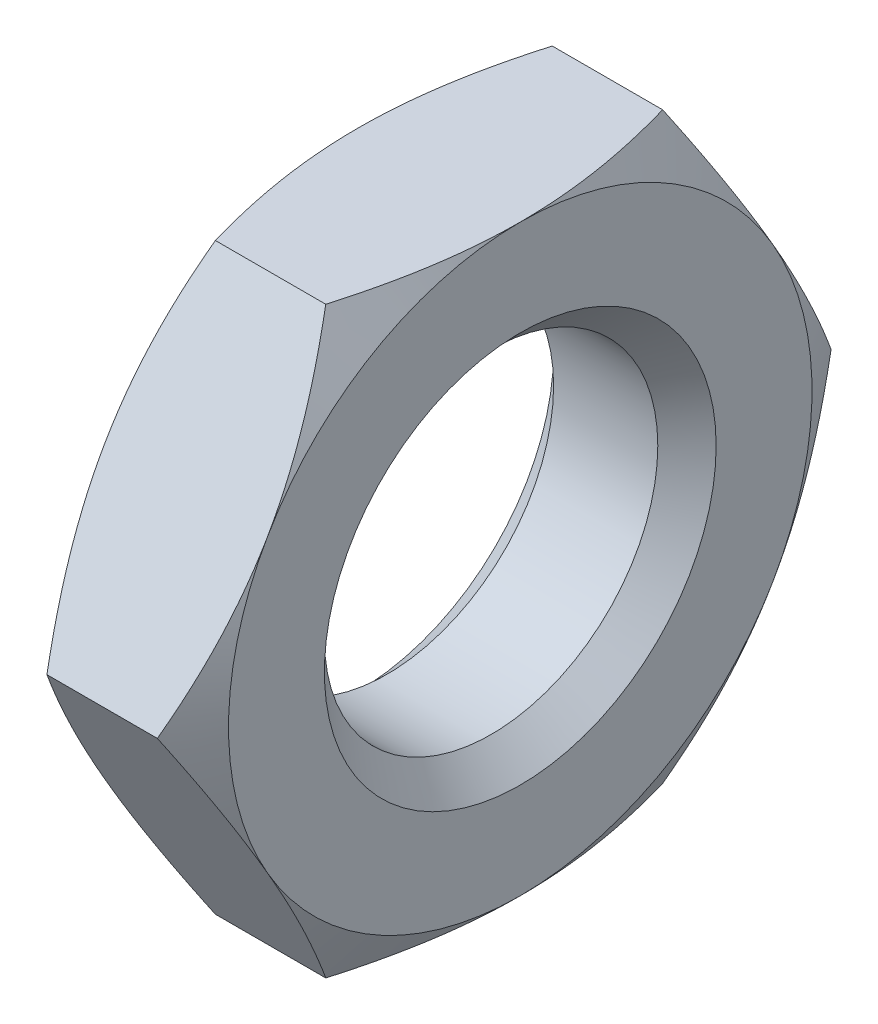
ISO-10303-21;
HEADER;
FILE_DESCRIPTION(('STEP AP214'),'2;1');
FILE_NAME('part.step','',(''),(''),'','','');
FILE_SCHEMA(('AUTOMOTIVE_DESIGN { 1 0 10303 214 1 1 1 1 }'));
ENDSEC;
DATA;
#1=APPLICATION_CONTEXT('core data for automotive mechanical design processes');
#2=APPLICATION_PROTOCOL_DEFINITION('international standard','automotive_design',2000,#1);
#3=PRODUCT_CONTEXT('',#1,'mechanical');
#4=PRODUCT('Part','Part','',(#3));
#5=PRODUCT_RELATED_PRODUCT_CATEGORY('part','',(#4));
#6=PRODUCT_DEFINITION_FORMATION('','',#4);
#7=PRODUCT_DEFINITION_CONTEXT('part definition',#1,'design');
#8=PRODUCT_DEFINITION('design','',#6,#7);
#9=PRODUCT_DEFINITION_SHAPE('','',#8);
#10=(LENGTH_UNIT() NAMED_UNIT(*) SI_UNIT(.MILLI.,.METRE.));
#11=(NAMED_UNIT(*) PLANE_ANGLE_UNIT() SI_UNIT($,.RADIAN.));
#12=(NAMED_UNIT(*) SI_UNIT($,.STERADIAN.) SOLID_ANGLE_UNIT());
#13=UNCERTAINTY_MEASURE_WITH_UNIT(LENGTH_MEASURE(1.E-05),#10,'distance_accuracy_value','');
#14=(GEOMETRIC_REPRESENTATION_CONTEXT(3) GLOBAL_UNCERTAINTY_ASSIGNED_CONTEXT((#13)) GLOBAL_UNIT_ASSIGNED_CONTEXT((#10,
#11,#12)) REPRESENTATION_CONTEXT('',''));
#15=CARTESIAN_POINT('',(0.,0.,0.));
#16=DIRECTION('',(0.,0.,1.));
#17=DIRECTION('',(1.,0.,0.));
#18=AXIS2_PLACEMENT_3D('',#15,#16,#17);
#19=CARTESIAN_POINT('',(1.95,3.5,-2.02072594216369));
#20=DIRECTION('',(1.,0.,0.));
#21=DIRECTION('',(0.,0.,-1.));
#22=AXIS2_PLACEMENT_3D('',#19,#20,#21);
#23=PLANE('',#22);
#24=CARTESIAN_POINT('',(1.95,0.,0.));
#25=DIRECTION('',(1.,0.,0.));
#26=DIRECTION('',(0.,0.,-1.));
#27=AXIS2_PLACEMENT_3D('',#24,#25,#26);
#28=CIRCLE('',#27,2.35);
#29=CARTESIAN_POINT('',(1.95,0.,-2.35));
#30=VERTEX_POINT('',#29);
#31=EDGE_CURVE('E11',#30,#30,#28,.F.);
#32=ORIENTED_EDGE('',*,*,#31,.T.);
#33=EDGE_LOOP('',(#32));
#34=FACE_BOUND('',#33,.T.);
#35=CARTESIAN_POINT('',(1.95,0.,0.));
#36=DIRECTION('',(1.,0.,0.));
#37=DIRECTION('',(0.,0.,-1.));
#38=AXIS2_PLACEMENT_3D('',#35,#36,#37);
#39=CIRCLE('',#38,3.5);
#40=CARTESIAN_POINT('',(1.95,-3.5,0.));
#41=VERTEX_POINT('',#40);
#42=CARTESIAN_POINT('',(1.95,-1.75,-3.03108891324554));
#43=VERTEX_POINT('',#42);
#44=EDGE_CURVE('E142',#41,#43,#39,.T.);
#45=ORIENTED_EDGE('',*,*,#44,.T.);
#46=CARTESIAN_POINT('',(1.95,1.75,-3.03108891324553));
#47=VERTEX_POINT('',#46);
#48=EDGE_CURVE('E130',#43,#47,#39,.T.);
#49=ORIENTED_EDGE('',*,*,#48,.T.);
#50=CARTESIAN_POINT('',(1.95,3.5,0.));
#51=VERTEX_POINT('',#50);
#52=EDGE_CURVE('E144',#47,#51,#39,.T.);
#53=ORIENTED_EDGE('',*,*,#52,.T.);
#54=CARTESIAN_POINT('',(1.95,1.75,3.03108891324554));
#55=VERTEX_POINT('',#54);
#56=EDGE_CURVE('E55',#51,#55,#39,.T.);
#57=ORIENTED_EDGE('',*,*,#56,.T.);
#58=CARTESIAN_POINT('',(1.95,-1.75,3.03108891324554));
#59=VERTEX_POINT('',#58);
#60=EDGE_CURVE('E63',#55,#59,#39,.T.);
#61=ORIENTED_EDGE('',*,*,#60,.T.);
#62=EDGE_CURVE('E166',#59,#41,#39,.T.);
#63=ORIENTED_EDGE('',*,*,#62,.T.);
#64=EDGE_LOOP('',(#45,#49,#53,#57,#61,#63));
#65=FACE_BOUND('',#64,.T.);
#66=ADVANCED_FACE('F39',(#34,#65),#23,.T.);
#67=CARTESIAN_POINT('',(0.,3.5,-2.02072594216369));
#68=DIRECTION('',(1.,0.,0.));
#69=DIRECTION('',(0.,0.,-1.));
#70=AXIS2_PLACEMENT_3D('',#67,#68,#69);
#71=PLANE('',#70);
#72=CARTESIAN_POINT('',(0.,0.,0.));
#73=DIRECTION('',(1.,0.,0.));
#74=DIRECTION('',(0.,0.,-1.));
#75=AXIS2_PLACEMENT_3D('',#72,#73,#74);
#76=CIRCLE('',#75,2.35);
#77=CARTESIAN_POINT('',(0.,0.,-2.35));
#78=VERTEX_POINT('',#77);
#79=EDGE_CURVE('E164',#78,#78,#76,.T.);
#80=ORIENTED_EDGE('',*,*,#79,.T.);
#81=EDGE_LOOP('',(#80));
#82=FACE_BOUND('',#81,.T.);
#83=CARTESIAN_POINT('',(0.,0.,0.));
#84=DIRECTION('',(1.,0.,0.));
#85=DIRECTION('',(0.,0.,-1.));
#86=AXIS2_PLACEMENT_3D('',#83,#84,#85);
#87=CIRCLE('',#86,3.5);
#88=CARTESIAN_POINT('',(0.,-1.75,-3.03108891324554));
#89=VERTEX_POINT('',#88);
#90=CARTESIAN_POINT('',(0.,1.75,-3.03108891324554));
#91=VERTEX_POINT('',#90);
#92=EDGE_CURVE('E173',#89,#91,#87,.T.);
#93=ORIENTED_EDGE('',*,*,#92,.F.);
#94=CARTESIAN_POINT('',(0.,-3.5,0.));
#95=VERTEX_POINT('',#94);
#96=EDGE_CURVE('E320',#95,#89,#87,.T.);
#97=ORIENTED_EDGE('',*,*,#96,.F.);
#98=CARTESIAN_POINT('',(0.,-1.75,3.03108891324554));
#99=VERTEX_POINT('',#98);
#100=EDGE_CURVE('E323',#99,#95,#87,.T.);
#101=ORIENTED_EDGE('',*,*,#100,.F.);
#102=CARTESIAN_POINT('',(0.,1.75,3.03108891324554));
#103=VERTEX_POINT('',#102);
#104=EDGE_CURVE('E328',#103,#99,#87,.T.);
#105=ORIENTED_EDGE('',*,*,#104,.F.);
#106=CARTESIAN_POINT('',(0.,3.5,0.));
#107=VERTEX_POINT('',#106);
#108=EDGE_CURVE('E178',#107,#103,#87,.T.);
#109=ORIENTED_EDGE('',*,*,#108,.F.);
#110=EDGE_CURVE('E174',#91,#107,#87,.T.);
#111=ORIENTED_EDGE('',*,*,#110,.F.);
#112=EDGE_LOOP('',(#93,#97,#101,#105,#109,#111));
#113=FACE_BOUND('',#112,.T.);
#114=ADVANCED_FACE('F321',(#82,#113),#71,.F.);
#115=CARTESIAN_POINT('',(1.95,0.,0.));
#116=DIRECTION('',(-1.,0.,0.));
#117=DIRECTION('',(0.,0.,1.));
#118=AXIS2_PLACEMENT_3D('',#115,#116,#117);
#119=CYLINDRICAL_SURFACE('',#118,2.);
#120=CARTESIAN_POINT('',(0.349999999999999,0.,0.));
#121=DIRECTION('',(1.,0.,0.));
#122=DIRECTION('',(0.,0.,-1.));
#123=AXIS2_PLACEMENT_3D('',#120,#121,#122);
#124=CIRCLE('',#123,2.);
#125=CARTESIAN_POINT('',(0.349999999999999,0.,-2.));
#126=VERTEX_POINT('',#125);
#127=EDGE_CURVE('E48',#126,#126,#124,.F.);
#128=ORIENTED_EDGE('',*,*,#127,.T.);
#129=EDGE_LOOP('',(#128));
#130=FACE_BOUND('',#129,.T.);
#131=CARTESIAN_POINT('',(1.6,0.,0.));
#132=DIRECTION('',(1.,0.,0.));
#133=DIRECTION('',(0.,0.,-1.));
#134=AXIS2_PLACEMENT_3D('',#131,#132,#133);
#135=CIRCLE('',#134,2.);
#136=CARTESIAN_POINT('',(1.6,0.,-2.));
#137=VERTEX_POINT('',#136);
#138=EDGE_CURVE('E387',#137,#137,#135,.T.);
#139=ORIENTED_EDGE('',*,*,#138,.T.);
#140=EDGE_LOOP('',(#139));
#141=FACE_BOUND('',#140,.T.);
#142=ADVANCED_FACE('F234',(#130,#141),#119,.F.);
#143=CARTESIAN_POINT('',(0.,0.,0.));
#144=DIRECTION('',(1.,0.,0.));
#145=DIRECTION('',(0.,0.,-1.));
#146=AXIS2_PLACEMENT_3D('',#143,#144,#145);
#147=CONICAL_SURFACE('',#146,3.5,1.0471975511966);
#148=CARTESIAN_POINT('',(0.31267406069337,-3.5002,-2.02061047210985));
#149=CARTESIAN_POINT('',(0.261385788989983,-3.34639282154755,-2.10941108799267));
#150=CARTESIAN_POINT('',(0.214740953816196,-3.19125798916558,-2.19897822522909));
#151=CARTESIAN_POINT('',(0.133321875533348,-2.87830199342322,-2.37966345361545));
#152=CARTESIAN_POINT('',(0.0985764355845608,-2.7204752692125,-2.47078475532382));
#153=CARTESIAN_POINT('',(0.0444900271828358,-2.40677778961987,-2.65189807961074));
#154=CARTESIAN_POINT('',(0.0247890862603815,-2.25095530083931,-2.74186223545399));
#155=CARTESIAN_POINT('',(0.00127013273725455,-1.93857711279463,-2.92221386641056));
#156=CARTESIAN_POINT('',(-0.00256735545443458,-1.78202254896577,-3.01260068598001));
#157=CARTESIAN_POINT('',(0.00541530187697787,-1.48949078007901,-3.1814939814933));
#158=CARTESIAN_POINT('',(0.0152754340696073,-1.35346978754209,-3.26002573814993));
#159=CARTESIAN_POINT('',(0.0465264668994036,-1.08231397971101,-3.41657761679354));
#160=CARTESIAN_POINT('',(0.0679280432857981,-0.947180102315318,-3.49459719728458));
#161=CARTESIAN_POINT('',(0.121430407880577,-0.675465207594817,-3.65147186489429));
#162=CARTESIAN_POINT('',(0.153757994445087,-0.538918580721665,-3.73030709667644));
#163=CARTESIAN_POINT('',(0.227128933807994,-0.267861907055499,-3.88680174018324));
#164=CARTESIAN_POINT('',(0.268155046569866,-0.133348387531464,-3.96446315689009));
#165=CARTESIAN_POINT('',(0.31267406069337,0.000199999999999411,-4.04156735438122));
#166=B_SPLINE_CURVE_WITH_KNOTS('',3,(#148,#149,#150,#151,#152,#153,#154,#155,#156,#157,#158,
#159,#160,#161,#162,#163,#164,#165),.UNSPECIFIED.,.F.,.F.,(4,2,2,2,2,2,2,2,4),(0.,
0.554793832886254,1.11092123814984,1.65328467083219,2.19498204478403,2.6666513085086,
3.13875761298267,3.6213361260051,4.10296698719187),.UNSPECIFIED.);
#167=CARTESIAN_POINT('',(0.312607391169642,0.,-4.04145188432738));
#168=VERTEX_POINT('',#167);
#169=EDGE_CURVE('E334',#89,#168,#166,.T.);
#170=ORIENTED_EDGE('',*,*,#169,.F.);
#171=ORIENTED_EDGE('',*,*,#92,.T.);
#172=CARTESIAN_POINT('',(0.31267406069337,-0.000200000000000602,-4.04156735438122));
#173=CARTESIAN_POINT('',(0.261385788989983,0.153607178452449,-3.9527667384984));
#174=CARTESIAN_POINT('',(0.214740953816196,0.308742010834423,-3.86319960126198));
#175=CARTESIAN_POINT('',(0.133321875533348,0.621698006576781,-3.68251437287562));
#176=CARTESIAN_POINT('',(0.0985764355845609,0.779524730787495,-3.59139307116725));
#177=CARTESIAN_POINT('',(0.0444900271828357,1.09322221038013,-3.41027974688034));
#178=CARTESIAN_POINT('',(0.0247890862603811,1.24904469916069,-3.32031559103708));
#179=CARTESIAN_POINT('',(0.00127013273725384,1.56142288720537,-3.13996396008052));
#180=CARTESIAN_POINT('',(-0.00256735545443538,1.71797745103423,-3.04957714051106));
#181=CARTESIAN_POINT('',(0.00541530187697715,2.01050921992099,-2.88068384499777));
#182=CARTESIAN_POINT('',(0.0152754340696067,2.14653021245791,-2.80215208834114));
#183=CARTESIAN_POINT('',(0.046526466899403,2.41768602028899,-2.64560020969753));
#184=CARTESIAN_POINT('',(0.0679280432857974,2.55281989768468,-2.5675806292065));
#185=CARTESIAN_POINT('',(0.121430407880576,2.82453479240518,-2.41070596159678));
#186=CARTESIAN_POINT('',(0.153757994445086,2.96108141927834,-2.33187072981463));
#187=CARTESIAN_POINT('',(0.227128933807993,3.2321380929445,-2.17537608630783));
#188=CARTESIAN_POINT('',(0.268155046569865,3.36665161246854,-2.09771466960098));
#189=CARTESIAN_POINT('',(0.312674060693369,3.5002,-2.02061047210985));
#190=B_SPLINE_CURVE_WITH_KNOTS('',3,(#172,#173,#174,#175,#176,#177,#178,#179,#180,#181,#182,
#183,#184,#185,#186,#187,#188,#189),.UNSPECIFIED.,.F.,.F.,(4,2,2,2,2,2,2,2,4),(0.,
0.554793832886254,1.11092123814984,1.65328467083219,2.19498204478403,2.6666513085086,
3.13875761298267,3.6213361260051,4.10296698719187),.UNSPECIFIED.);
#191=EDGE_CURVE('E215',#168,#91,#190,.T.);
#192=ORIENTED_EDGE('',*,*,#191,.F.);
#193=EDGE_LOOP('',(#170,#171,#192));
#194=FACE_BOUND('',#193,.T.);
#195=ADVANCED_FACE('F194',(#194),#147,.T.);
#196=ORIENTED_EDGE('',*,*,#96,.T.);
#197=CARTESIAN_POINT('',(0.312607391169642,-3.5,-2.02072594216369));
#198=VERTEX_POINT('',#197);
#199=EDGE_CURVE('E156',#198,#89,#166,.T.);
#200=ORIENTED_EDGE('',*,*,#199,.F.);
#201=CARTESIAN_POINT('',(1.71963349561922,-3.5,-5.4516847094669));
#202=CARTESIAN_POINT('',(1.64528783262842,-3.5,-5.29861937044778));
#203=CARTESIAN_POINT('',(1.57164816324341,-3.5,-5.14520521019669));
#204=CARTESIAN_POINT('',(1.42617738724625,-3.5,-4.83749384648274));
#205=CARTESIAN_POINT('',(1.35434656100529,-3.5,-4.68319651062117));
#206=CARTESIAN_POINT('',(1.21253372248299,-3.5,-4.37274971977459));
#207=CARTESIAN_POINT('',(1.14256369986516,-3.5,-4.21659476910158));
#208=CARTESIAN_POINT('',(1.0054553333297,-3.5,-3.90305120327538));
#209=CARTESIAN_POINT('',(0.938316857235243,-3.5,-3.74566264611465));
#210=CARTESIAN_POINT('',(0.805478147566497,-3.5,-3.42422286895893));
#211=CARTESIAN_POINT('',(0.73989693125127,-3.5,-3.26012219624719));
#212=CARTESIAN_POINT('',(0.613640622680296,-3.5,-2.93000971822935));
#213=CARTESIAN_POINT('',(0.552966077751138,-3.5,-2.76399770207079));
#214=CARTESIAN_POINT('',(0.438098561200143,-3.5,-2.43010161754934));
#215=CARTESIAN_POINT('',(0.38389266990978,-3.5,-2.26222203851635));
#216=CARTESIAN_POINT('',(0.283686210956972,-3.5,-1.9240546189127));
#217=CARTESIAN_POINT('',(0.23768308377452,-3.5,-1.75376754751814));
#218=CARTESIAN_POINT('',(0.156321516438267,-3.5,-1.41164298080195));
#219=CARTESIAN_POINT('',(0.120904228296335,-3.5,-1.23981974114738));
#220=CARTESIAN_POINT('',(0.0626975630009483,-3.5,-0.894011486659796));
#221=CARTESIAN_POINT('',(0.0399069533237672,-3.5,-0.720026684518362));
#222=CARTESIAN_POINT('',(0.00906913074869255,-3.5,-0.373046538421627));
#223=CARTESIAN_POINT('',(0.000830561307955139,-3.5,-0.200068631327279));
#224=CARTESIAN_POINT('',(-0.000709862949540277,-3.5,0.145968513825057));
#225=CARTESIAN_POINT('',(0.00598850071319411,-3.5,0.319027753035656));
#226=CARTESIAN_POINT('',(0.029506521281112,-3.5,0.612132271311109));
#227=CARTESIAN_POINT('',(0.042681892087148,-3.5,0.732488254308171));
#228=CARTESIAN_POINT('',(0.0754496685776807,-3.5,0.972329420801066));
#229=CARTESIAN_POINT('',(0.0950429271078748,-3.5,1.09181448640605));
#230=CARTESIAN_POINT('',(0.162420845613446,-3.5,1.44879897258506));
#231=CARTESIAN_POINT('',(0.218791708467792,-3.5,1.68469644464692));
#232=CARTESIAN_POINT('',(0.316668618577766,-3.5,2.03744937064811));
#233=CARTESIAN_POINT('',(0.3519719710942,-3.5,2.15613014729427));
#234=CARTESIAN_POINT('',(0.426277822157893,-3.5,2.39233913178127));
#235=CARTESIAN_POINT('',(0.465280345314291,-3.5,2.50986733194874));
#236=CARTESIAN_POINT('',(0.546355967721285,-3.5,2.74380766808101));
#237=CARTESIAN_POINT('',(0.588428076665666,-3.5,2.86022015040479));
#238=CARTESIAN_POINT('',(0.675144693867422,-3.5,3.0920785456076));
#239=CARTESIAN_POINT('',(0.71978917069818,-3.5,3.20752447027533));
#240=CARTESIAN_POINT('',(0.828769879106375,-3.5,3.48169841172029));
#241=CARTESIAN_POINT('',(0.894088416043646,-3.5,3.64003527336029));
#242=CARTESIAN_POINT('',(1.0279532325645,-3.5,3.95534262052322));
#243=CARTESIAN_POINT('',(1.0964997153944,-3.5,4.11231301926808));
#244=CARTESIAN_POINT('',(1.23616619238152,-3.5,4.42514169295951));
#245=CARTESIAN_POINT('',(1.30728673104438,-3.5,4.58099972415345));
#246=CARTESIAN_POINT('',(1.45158523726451,-3.5,4.8917619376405));
#247=CARTESIAN_POINT('',(1.52476325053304,-3.5,5.04666609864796));
#248=CARTESIAN_POINT('',(1.74692878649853,-3.5,5.51050514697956));
#249=CARTESIAN_POINT('',(1.89840348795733,-3.5,5.81824795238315));
#250=CARTESIAN_POINT('',(2.20582135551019,-3.5,6.43149278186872));
#251=CARTESIAN_POINT('',(2.36176469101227,-3.5,6.7369947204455));
#252=CARTESIAN_POINT('',(2.66339717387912,-3.5,7.32040881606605));
#253=CARTESIAN_POINT('',(2.80882838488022,-3.5,7.5984545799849));
#254=CARTESIAN_POINT('',(3.10167719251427,-3.5,8.15350948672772));
#255=CARTESIAN_POINT('',(3.24909486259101,-3.5,8.43051859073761));
#256=CARTESIAN_POINT('',(3.5450610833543,-3.5,8.98301611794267));
#257=CARTESIAN_POINT('',(3.69360575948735,-3.5,9.25850661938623));
#258=CARTESIAN_POINT('',(3.99187945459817,-3.5,9.8088256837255));
#259=CARTESIAN_POINT('',(4.14160840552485,-3.5,10.0836542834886));
#260=CARTESIAN_POINT('',(4.29177841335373,-3.5,10.3582398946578));
#261=B_SPLINE_CURVE_WITH_KNOTS('',3,(#201,#202,#203,#204,#205,#206,#207,#208,#209,#210,#211,
#212,#213,#214,#215,#216,#217,#218,#219,#220,#221,#222,#223,#224,#225,#226,#227,#228,#229,#230,
#231,#232,#233,#234,#235,#236,#237,#238,#239,#240,#241,#242,#243,#244,#245,#246,#247,#248,#249,
#250,#251,#252,#253,#254,#255,#256,#257,#258,#259,#260),.UNSPECIFIED.,.F.,.F.,(4,2,2,2,2,2,2,2,
2,2,2,2,2,2,2,2,2,2,2,2,2,2,2,2,2,2,2,2,2,4),(0.,0.510502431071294,1.0210835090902,
1.53440448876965,2.04770148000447,2.57780055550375,3.10795868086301,3.63703955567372,
4.16595505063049,4.69187308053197,5.21773976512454,5.73663842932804,6.2555446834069,
6.61859394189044,6.98169146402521,7.70828005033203,8.07970882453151,8.45114006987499,
8.82245200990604,9.1937594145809,9.70755293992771,10.2213788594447,10.7353141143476,
11.2492607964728,12.2782033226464,13.307184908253,14.2485228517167,15.189895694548,
16.1288519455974,17.0677546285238),.UNSPECIFIED.);
#262=EDGE_CURVE('E177',#95,#198,#261,.F.);
#263=ORIENTED_EDGE('',*,*,#262,.F.);
#264=EDGE_LOOP('',(#196,#200,#263));
#265=FACE_BOUND('',#264,.T.);
#266=ADVANCED_FACE('F354',(#265),#147,.T.);
#267=CARTESIAN_POINT('',(0.975,0.,0.));
#268=DIRECTION('',(-1.,0.,0.));
#269=DIRECTION('',(0.,0.,1.));
#270=AXIS2_PLACEMENT_3D('',#267,#268,#269);
#271=CONICAL_SURFACE('',#270,5.18874953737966,1.0471975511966);
#272=CARTESIAN_POINT('',(1.63732593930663,0.000199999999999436,-4.04156735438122));
#273=CARTESIAN_POINT('',(1.68861421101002,-0.15360717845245,-3.9527667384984));
#274=CARTESIAN_POINT('',(1.7352590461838,-0.308742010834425,-3.86319960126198));
#275=CARTESIAN_POINT('',(1.81667812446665,-0.621698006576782,-3.68251437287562));
#276=CARTESIAN_POINT('',(1.85142356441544,-0.779524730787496,-3.59139307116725));
#277=CARTESIAN_POINT('',(1.90550997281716,-1.09322221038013,-3.41027974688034));
#278=CARTESIAN_POINT('',(1.92521091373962,-1.24904469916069,-3.32031559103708));
#279=CARTESIAN_POINT('',(1.94872986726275,-1.56142288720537,-3.13996396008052));
#280=CARTESIAN_POINT('',(1.95256735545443,-1.71797745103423,-3.04957714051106));
#281=CARTESIAN_POINT('',(1.94458469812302,-2.01050921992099,-2.88068384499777));
#282=CARTESIAN_POINT('',(1.93472456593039,-2.14653021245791,-2.80215208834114));
#283=CARTESIAN_POINT('',(1.9034735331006,-2.41768602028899,-2.64560020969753));
#284=CARTESIAN_POINT('',(1.8820719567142,-2.55281989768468,-2.5675806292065));
#285=CARTESIAN_POINT('',(1.82856959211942,-2.82453479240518,-2.41070596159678));
#286=CARTESIAN_POINT('',(1.79624200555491,-2.96108141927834,-2.33187072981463));
#287=CARTESIAN_POINT('',(1.72287106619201,-3.2321380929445,-2.17537608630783));
#288=CARTESIAN_POINT('',(1.68184495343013,-3.36665161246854,-2.09771466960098));
#289=CARTESIAN_POINT('',(1.63732593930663,-3.5002,-2.02061047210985));
#290=B_SPLINE_CURVE_WITH_KNOTS('',3,(#272,#273,#274,#275,#276,#277,#278,#279,#280,#281,#282,
#283,#284,#285,#286,#287,#288,#289),.UNSPECIFIED.,.F.,.F.,(4,2,2,2,2,2,2,2,4),(0.,
0.554793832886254,1.11092123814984,1.65328467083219,2.19498204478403,2.6666513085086,
3.13875761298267,3.6213361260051,4.10296698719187),.UNSPECIFIED.);
#291=CARTESIAN_POINT('',(1.63739260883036,-3.5,-2.02072594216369));
#292=VERTEX_POINT('',#291);
#293=EDGE_CURVE('E147',#43,#292,#290,.T.);
#294=ORIENTED_EDGE('',*,*,#293,.F.);
#295=ORIENTED_EDGE('',*,*,#44,.F.);
#296=CARTESIAN_POINT('',(0.230366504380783,-3.5,-5.4516847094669));
#297=CARTESIAN_POINT('',(0.304712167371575,-3.5,-5.29861937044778));
#298=CARTESIAN_POINT('',(0.37835183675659,-3.5,-5.14520521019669));
#299=CARTESIAN_POINT('',(0.523822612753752,-3.5,-4.83749384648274));
#300=CARTESIAN_POINT('',(0.595653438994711,-3.5,-4.68319651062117));
#301=CARTESIAN_POINT('',(0.737466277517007,-3.5,-4.37274971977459));
#302=CARTESIAN_POINT('',(0.807436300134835,-3.5,-4.21659476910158));
#303=CARTESIAN_POINT('',(0.944544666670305,-3.5,-3.90305120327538));
#304=CARTESIAN_POINT('',(1.01168314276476,-3.5,-3.74566264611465));
#305=CARTESIAN_POINT('',(1.1445218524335,-3.5,-3.42422286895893));
#306=CARTESIAN_POINT('',(1.21010306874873,-3.5,-3.26012219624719));
#307=CARTESIAN_POINT('',(1.3363593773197,-3.5,-2.93000971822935));
#308=CARTESIAN_POINT('',(1.39703392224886,-3.5,-2.76399770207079));
#309=CARTESIAN_POINT('',(1.51190143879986,-3.5,-2.43010161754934));
#310=CARTESIAN_POINT('',(1.56610733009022,-3.5,-2.26222203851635));
#311=CARTESIAN_POINT('',(1.66631378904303,-3.5,-1.9240546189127));
#312=CARTESIAN_POINT('',(1.71231691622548,-3.5,-1.75376754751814));
#313=CARTESIAN_POINT('',(1.79367848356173,-3.5,-1.41164298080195));
#314=CARTESIAN_POINT('',(1.82909577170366,-3.5,-1.23981974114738));
#315=CARTESIAN_POINT('',(1.88730243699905,-3.5,-0.894011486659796));
#316=CARTESIAN_POINT('',(1.91009304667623,-3.5,-0.720026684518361));
#317=CARTESIAN_POINT('',(1.94093086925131,-3.5,-0.373046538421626));
#318=CARTESIAN_POINT('',(1.94916943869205,-3.5,-0.200068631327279));
#319=CARTESIAN_POINT('',(1.95070986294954,-3.5,0.145968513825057));
#320=CARTESIAN_POINT('',(1.94401149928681,-3.5,0.319027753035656));
#321=CARTESIAN_POINT('',(1.92049347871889,-3.5,0.612132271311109));
#322=CARTESIAN_POINT('',(1.90731810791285,-3.5,0.732488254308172));
#323=CARTESIAN_POINT('',(1.87455033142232,-3.5,0.972329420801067));
#324=CARTESIAN_POINT('',(1.85495707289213,-3.5,1.09181448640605));
#325=CARTESIAN_POINT('',(1.78757915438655,-3.5,1.44879897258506));
#326=CARTESIAN_POINT('',(1.73120829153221,-3.5,1.68469644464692));
#327=CARTESIAN_POINT('',(1.63333138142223,-3.5,2.03744937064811));
#328=CARTESIAN_POINT('',(1.5980280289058,-3.5,2.15613014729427));
#329=CARTESIAN_POINT('',(1.52372217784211,-3.5,2.39233913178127));
#330=CARTESIAN_POINT('',(1.48471965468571,-3.5,2.50986733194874));
#331=CARTESIAN_POINT('',(1.40364403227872,-3.5,2.74380766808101));
#332=CARTESIAN_POINT('',(1.36157192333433,-3.5,2.86022015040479));
#333=CARTESIAN_POINT('',(1.27485530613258,-3.5,3.0920785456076));
#334=CARTESIAN_POINT('',(1.23021082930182,-3.5,3.20752447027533));
#335=CARTESIAN_POINT('',(1.12123012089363,-3.5,3.48169841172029));
#336=CARTESIAN_POINT('',(1.05591158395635,-3.5,3.64003527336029));
#337=CARTESIAN_POINT('',(0.922046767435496,-3.5,3.95534262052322));
#338=CARTESIAN_POINT('',(0.853500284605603,-3.5,4.11231301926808));
#339=CARTESIAN_POINT('',(0.713833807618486,-3.5,4.42514169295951));
#340=CARTESIAN_POINT('',(0.642713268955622,-3.5,4.58099972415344));
#341=CARTESIAN_POINT('',(0.498414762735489,-3.5,4.89176193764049));
#342=CARTESIAN_POINT('',(0.425236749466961,-3.5,5.04666609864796));
#343=CARTESIAN_POINT('',(0.203071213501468,-3.5,5.51050514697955));
#344=CARTESIAN_POINT('',(0.0515965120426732,-3.5,5.81824795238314));
#345=CARTESIAN_POINT('',(-0.255821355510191,-3.5,6.43149278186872));
#346=CARTESIAN_POINT('',(-0.411764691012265,-3.5,6.7369947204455));
#347=CARTESIAN_POINT('',(-0.713397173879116,-3.5,7.32040881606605));
#348=CARTESIAN_POINT('',(-0.858828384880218,-3.5,7.5984545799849));
#349=CARTESIAN_POINT('',(-1.15167719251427,-3.5,8.15350948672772));
#350=CARTESIAN_POINT('',(-1.29909486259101,-3.5,8.4305185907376));
#351=CARTESIAN_POINT('',(-1.5950610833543,-3.5,8.98301611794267));
#352=CARTESIAN_POINT('',(-1.74360575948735,-3.5,9.25850661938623));
#353=CARTESIAN_POINT('',(-2.04187945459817,-3.5,9.8088256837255));
#354=CARTESIAN_POINT('',(-2.19160840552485,-3.5,10.0836542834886));
#355=CARTESIAN_POINT('',(-2.34177841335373,-3.5,10.3582398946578));
#356=B_SPLINE_CURVE_WITH_KNOTS('',3,(#296,#297,#298,#299,#300,#301,#302,#303,#304,#305,#306,
#307,#308,#309,#310,#311,#312,#313,#314,#315,#316,#317,#318,#319,#320,#321,#322,#323,#324,#325,
#326,#327,#328,#329,#330,#331,#332,#333,#334,#335,#336,#337,#338,#339,#340,#341,#342,#343,#344,
#345,#346,#347,#348,#349,#350,#351,#352,#353,#354,#355),.UNSPECIFIED.,.F.,.F.,(4,2,2,2,2,2,2,2,
2,2,2,2,2,2,2,2,2,2,2,2,2,2,2,2,2,2,2,2,2,4),(0.,0.510502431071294,1.0210835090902,
1.53440448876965,2.04770148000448,2.57780055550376,3.10795868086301,3.63703955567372,
4.16595505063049,4.69187308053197,5.21773976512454,5.73663842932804,6.2555446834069,
6.61859394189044,6.98169146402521,7.70828005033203,8.07970882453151,8.45114006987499,
8.82245200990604,9.1937594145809,9.70755293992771,10.2213788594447,10.7353141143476,
11.2492607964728,12.2782033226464,13.307184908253,14.2485228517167,15.189895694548,
16.1288519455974,17.0677546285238),.UNSPECIFIED.);
#357=EDGE_CURVE('E151',#292,#41,#356,.T.);
#358=ORIENTED_EDGE('',*,*,#357,.F.);
#359=EDGE_LOOP('',(#294,#295,#358));
#360=FACE_BOUND('',#359,.T.);
#361=ADVANCED_FACE('F148',(#360),#271,.T.);
#362=ORIENTED_EDGE('',*,*,#48,.F.);
#363=CARTESIAN_POINT('',(1.63739260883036,0.,-4.04145188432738));
#364=VERTEX_POINT('',#363);
#365=EDGE_CURVE('E134',#364,#43,#290,.T.);
#366=ORIENTED_EDGE('',*,*,#365,.F.);
#367=CARTESIAN_POINT('',(1.63732593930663,3.5002,-2.02061047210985));
#368=CARTESIAN_POINT('',(1.68861421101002,3.34639282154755,-2.10941108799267));
#369=CARTESIAN_POINT('',(1.7352590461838,3.19125798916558,-2.19897822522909));
#370=CARTESIAN_POINT('',(1.81667812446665,2.87830199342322,-2.37966345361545));
#371=CARTESIAN_POINT('',(1.85142356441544,2.72047526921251,-2.47078475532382));
#372=CARTESIAN_POINT('',(1.90550997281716,2.40677778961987,-2.65189807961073));
#373=CARTESIAN_POINT('',(1.92521091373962,2.25095530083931,-2.74186223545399));
#374=CARTESIAN_POINT('',(1.94872986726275,1.93857711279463,-2.92221386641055));
#375=CARTESIAN_POINT('',(1.95256735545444,1.78202254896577,-3.01260068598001));
#376=CARTESIAN_POINT('',(1.94458469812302,1.48949078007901,-3.1814939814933));
#377=CARTESIAN_POINT('',(1.93472456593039,1.35346978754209,-3.26002573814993));
#378=CARTESIAN_POINT('',(1.9034735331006,1.08231397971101,-3.41657761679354));
#379=CARTESIAN_POINT('',(1.8820719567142,0.947180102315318,-3.49459719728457));
#380=CARTESIAN_POINT('',(1.82856959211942,0.675465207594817,-3.65147186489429));
#381=CARTESIAN_POINT('',(1.79624200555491,0.538918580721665,-3.73030709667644));
#382=CARTESIAN_POINT('',(1.72287106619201,0.267861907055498,-3.88680174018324));
#383=CARTESIAN_POINT('',(1.68184495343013,0.133348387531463,-3.96446315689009));
#384=CARTESIAN_POINT('',(1.63732593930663,-0.000200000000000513,-4.04156735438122));
#385=B_SPLINE_CURVE_WITH_KNOTS('',3,(#367,#368,#369,#370,#371,#372,#373,#374,#375,#376,#377,
#378,#379,#380,#381,#382,#383,#384),.UNSPECIFIED.,.F.,.F.,(4,2,2,2,2,2,2,2,4),(0.,
0.554793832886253,1.11092123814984,1.65328467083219,2.19498204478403,2.6666513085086,
3.13875761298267,3.6213361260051,4.10296698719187),.UNSPECIFIED.);
#386=EDGE_CURVE('E136',#47,#364,#385,.T.);
#387=ORIENTED_EDGE('',*,*,#386,.F.);
#388=EDGE_LOOP('',(#362,#366,#387));
#389=FACE_BOUND('',#388,.T.);
#390=ADVANCED_FACE('F132',(#389),#271,.T.);
#391=ORIENTED_EDGE('',*,*,#100,.T.);
#392=CARTESIAN_POINT('',(0.312607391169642,-3.5,2.02072594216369));
#393=VERTEX_POINT('',#392);
#394=EDGE_CURVE('E187',#393,#95,#261,.F.);
#395=ORIENTED_EDGE('',*,*,#394,.F.);
#396=CARTESIAN_POINT('',(0.312674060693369,0.000200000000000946,4.04156735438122));
#397=CARTESIAN_POINT('',(0.261385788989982,-0.153607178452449,3.9527667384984));
#398=CARTESIAN_POINT('',(0.214740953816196,-0.308742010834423,3.86319960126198));
#399=CARTESIAN_POINT('',(0.133321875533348,-0.62169800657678,3.68251437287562));
#400=CARTESIAN_POINT('',(0.0985764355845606,-0.779524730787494,3.59139307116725));
#401=CARTESIAN_POINT('',(0.0444900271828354,-1.09322221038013,3.41027974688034));
#402=CARTESIAN_POINT('',(0.0247890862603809,-1.24904469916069,3.32031559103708));
#403=CARTESIAN_POINT('',(0.00127013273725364,-1.56142288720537,3.13996396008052));
#404=CARTESIAN_POINT('',(-0.00256735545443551,-1.71797745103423,3.04957714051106));
#405=CARTESIAN_POINT('',(0.00541530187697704,-2.01050921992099,2.88068384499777));
#406=CARTESIAN_POINT('',(0.0152754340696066,-2.14653021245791,2.80215208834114));
#407=CARTESIAN_POINT('',(0.0465264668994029,-2.41768602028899,2.64560020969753));
#408=CARTESIAN_POINT('',(0.0679280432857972,-2.55281989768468,2.5675806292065));
#409=CARTESIAN_POINT('',(0.121430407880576,-2.82453479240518,2.41070596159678));
#410=CARTESIAN_POINT('',(0.153757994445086,-2.96108141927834,2.33187072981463));
#411=CARTESIAN_POINT('',(0.227128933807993,-3.2321380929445,2.17537608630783));
#412=CARTESIAN_POINT('',(0.268155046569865,-3.36665161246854,2.09771466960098));
#413=CARTESIAN_POINT('',(0.312674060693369,-3.5002,2.02061047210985));
#414=B_SPLINE_CURVE_WITH_KNOTS('',3,(#396,#397,#398,#399,#400,#401,#402,#403,#404,#405,#406,
#407,#408,#409,#410,#411,#412,#413),.UNSPECIFIED.,.F.,.F.,(4,2,2,2,2,2,2,2,4),(0.,
0.554793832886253,1.11092123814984,1.65328467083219,2.19498204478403,2.6666513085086,
3.13875761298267,3.6213361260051,4.10296698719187),.UNSPECIFIED.);
#415=EDGE_CURVE('E188',#99,#393,#414,.T.);
#416=ORIENTED_EDGE('',*,*,#415,.F.);
#417=EDGE_LOOP('',(#391,#395,#416));
#418=FACE_BOUND('',#417,.T.);
#419=ADVANCED_FACE('F353',(#418),#147,.T.);
#420=CARTESIAN_POINT('',(1.63739260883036,-3.5,2.02072594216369));
#421=VERTEX_POINT('',#420);
#422=EDGE_CURVE('E216',#41,#421,#356,.T.);
#423=ORIENTED_EDGE('',*,*,#422,.F.);
#424=ORIENTED_EDGE('',*,*,#62,.F.);
#425=CARTESIAN_POINT('',(1.63732593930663,-3.5002,2.02061047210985));
#426=CARTESIAN_POINT('',(1.68861421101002,-3.34639282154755,2.10941108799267));
#427=CARTESIAN_POINT('',(1.7352590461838,-3.19125798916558,2.19897822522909));
#428=CARTESIAN_POINT('',(1.81667812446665,-2.87830199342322,2.37966345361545));
#429=CARTESIAN_POINT('',(1.85142356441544,-2.7204752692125,2.47078475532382));
#430=CARTESIAN_POINT('',(1.90550997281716,-2.40677778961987,2.65189807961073));
#431=CARTESIAN_POINT('',(1.92521091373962,-2.25095530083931,2.74186223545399));
#432=CARTESIAN_POINT('',(1.94872986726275,-1.93857711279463,2.92221386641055));
#433=CARTESIAN_POINT('',(1.95256735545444,-1.78202254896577,3.01260068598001));
#434=CARTESIAN_POINT('',(1.94458469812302,-1.48949078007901,3.1814939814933));
#435=CARTESIAN_POINT('',(1.93472456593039,-1.35346978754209,3.26002573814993));
#436=CARTESIAN_POINT('',(1.9034735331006,-1.08231397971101,3.41657761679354));
#437=CARTESIAN_POINT('',(1.8820719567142,-0.947180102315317,3.49459719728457));
#438=CARTESIAN_POINT('',(1.82856959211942,-0.675465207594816,3.65147186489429));
#439=CARTESIAN_POINT('',(1.79624200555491,-0.538918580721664,3.73030709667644));
#440=CARTESIAN_POINT('',(1.72287106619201,-0.267861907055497,3.88680174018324));
#441=CARTESIAN_POINT('',(1.68184495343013,-0.133348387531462,3.96446315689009));
#442=CARTESIAN_POINT('',(1.63732593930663,0.000200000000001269,4.04156735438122));
#443=B_SPLINE_CURVE_WITH_KNOTS('',3,(#425,#426,#427,#428,#429,#430,#431,#432,#433,#434,#435,
#436,#437,#438,#439,#440,#441,#442),.UNSPECIFIED.,.F.,.F.,(4,2,2,2,2,2,2,2,4),(0.,
0.554793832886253,1.11092123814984,1.65328467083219,2.19498204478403,2.6666513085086,
3.13875761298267,3.6213361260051,4.10296698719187),.UNSPECIFIED.);
#444=EDGE_CURVE('E247',#421,#59,#443,.T.);
#445=ORIENTED_EDGE('',*,*,#444,.F.);
#446=EDGE_LOOP('',(#423,#424,#445));
#447=FACE_BOUND('',#446,.T.);
#448=ADVANCED_FACE('F431',(#447),#271,.T.);
#449=ORIENTED_EDGE('',*,*,#104,.T.);
#450=CARTESIAN_POINT('',(0.312607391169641,0.,4.04145188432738));
#451=VERTEX_POINT('',#450);
#452=EDGE_CURVE('E288',#451,#99,#414,.T.);
#453=ORIENTED_EDGE('',*,*,#452,.F.);
#454=CARTESIAN_POINT('',(0.31267406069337,3.5002,2.02061047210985));
#455=CARTESIAN_POINT('',(0.261385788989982,3.34639282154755,2.10941108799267));
#456=CARTESIAN_POINT('',(0.214740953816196,3.19125798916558,2.19897822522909));
#457=CARTESIAN_POINT('',(0.133321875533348,2.87830199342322,2.37966345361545));
#458=CARTESIAN_POINT('',(0.0985764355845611,2.7204752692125,2.47078475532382));
#459=CARTESIAN_POINT('',(0.0444900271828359,2.40677778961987,2.65189807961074));
#460=CARTESIAN_POINT('',(0.0247890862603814,2.25095530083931,2.74186223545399));
#461=CARTESIAN_POINT('',(0.00127013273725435,1.93857711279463,2.92221386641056));
#462=CARTESIAN_POINT('',(-0.00256735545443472,1.78202254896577,3.01260068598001));
#463=CARTESIAN_POINT('',(0.00541530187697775,1.48949078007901,3.1814939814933));
#464=CARTESIAN_POINT('',(0.0152754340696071,1.35346978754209,3.26002573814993));
#465=CARTESIAN_POINT('',(0.0465264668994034,1.08231397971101,3.41657761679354));
#466=CARTESIAN_POINT('',(0.0679280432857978,0.947180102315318,3.49459719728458));
#467=CARTESIAN_POINT('',(0.121430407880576,0.675465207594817,3.65147186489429));
#468=CARTESIAN_POINT('',(0.153757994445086,0.538918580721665,3.73030709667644));
#469=CARTESIAN_POINT('',(0.227128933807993,0.2678619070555,3.88680174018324));
#470=CARTESIAN_POINT('',(0.268155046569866,0.133348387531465,3.96446315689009));
#471=CARTESIAN_POINT('',(0.312674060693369,-0.000199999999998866,4.04156735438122));
#472=B_SPLINE_CURVE_WITH_KNOTS('',3,(#454,#455,#456,#457,#458,#459,#460,#461,#462,#463,#464,
#465,#466,#467,#468,#469,#470,#471),.UNSPECIFIED.,.F.,.F.,(4,2,2,2,2,2,2,2,4),(0.,
0.554793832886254,1.11092123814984,1.65328467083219,2.19498204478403,2.6666513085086,
3.13875761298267,3.62133612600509,4.10296698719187),.UNSPECIFIED.);
#473=EDGE_CURVE('E282',#103,#451,#472,.T.);
#474=ORIENTED_EDGE('',*,*,#473,.F.);
#475=EDGE_LOOP('',(#449,#453,#474));
#476=FACE_BOUND('',#475,.T.);
#477=ADVANCED_FACE('F232',(#476),#147,.T.);
#478=CARTESIAN_POINT('',(1.63739260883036,0.,4.04145188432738));
#479=VERTEX_POINT('',#478);
#480=EDGE_CURVE('E377',#59,#479,#443,.T.);
#481=ORIENTED_EDGE('',*,*,#480,.F.);
#482=ORIENTED_EDGE('',*,*,#60,.F.);
#483=CARTESIAN_POINT('',(1.63732593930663,-0.000199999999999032,4.04156735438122));
#484=CARTESIAN_POINT('',(1.68861421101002,0.153607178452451,3.9527667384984));
#485=CARTESIAN_POINT('',(1.7352590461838,0.308742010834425,3.86319960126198));
#486=CARTESIAN_POINT('',(1.81667812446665,0.621698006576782,3.68251437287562));
#487=CARTESIAN_POINT('',(1.85142356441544,0.779524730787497,3.59139307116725));
#488=CARTESIAN_POINT('',(1.90550997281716,1.09322221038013,3.41027974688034));
#489=CARTESIAN_POINT('',(1.92521091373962,1.24904469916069,3.32031559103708));
#490=CARTESIAN_POINT('',(1.94872986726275,1.56142288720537,3.13996396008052));
#491=CARTESIAN_POINT('',(1.95256735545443,1.71797745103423,3.04957714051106));
#492=CARTESIAN_POINT('',(1.94458469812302,2.01050921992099,2.88068384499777));
#493=CARTESIAN_POINT('',(1.93472456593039,2.14653021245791,2.80215208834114));
#494=CARTESIAN_POINT('',(1.9034735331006,2.417686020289,2.64560020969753));
#495=CARTESIAN_POINT('',(1.8820719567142,2.55281989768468,2.5675806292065));
#496=CARTESIAN_POINT('',(1.82856959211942,2.82453479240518,2.41070596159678));
#497=CARTESIAN_POINT('',(1.79624200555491,2.96108141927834,2.33187072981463));
#498=CARTESIAN_POINT('',(1.72287106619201,3.2321380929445,2.17537608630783));
#499=CARTESIAN_POINT('',(1.68184495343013,3.36665161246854,2.09771466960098));
#500=CARTESIAN_POINT('',(1.63732593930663,3.5002,2.02061047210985));
#501=B_SPLINE_CURVE_WITH_KNOTS('',3,(#483,#484,#485,#486,#487,#488,#489,#490,#491,#492,#493,
#494,#495,#496,#497,#498,#499,#500),.UNSPECIFIED.,.F.,.F.,(4,2,2,2,2,2,2,2,4),(0.,
0.554793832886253,1.11092123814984,1.65328467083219,2.19498204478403,2.6666513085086,
3.13875761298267,3.6213361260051,4.10296698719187),.UNSPECIFIED.);
#502=EDGE_CURVE('E372',#479,#55,#501,.T.);
#503=ORIENTED_EDGE('',*,*,#502,.F.);
#504=EDGE_LOOP('',(#481,#482,#503));
#505=FACE_BOUND('',#504,.T.);
#506=ADVANCED_FACE('F227',(#505),#271,.T.);
#507=ORIENTED_EDGE('',*,*,#108,.T.);
#508=CARTESIAN_POINT('',(0.312607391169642,3.5,2.02072594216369));
#509=VERTEX_POINT('',#508);
#510=EDGE_CURVE('E281',#509,#103,#472,.T.);
#511=ORIENTED_EDGE('',*,*,#510,.F.);
#512=CARTESIAN_POINT('',(1.71963349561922,3.5,-5.4516847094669));
#513=CARTESIAN_POINT('',(1.64528783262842,3.5,-5.29861937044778));
#514=CARTESIAN_POINT('',(1.57164816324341,3.5,-5.14520521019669));
#515=CARTESIAN_POINT('',(1.42617738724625,3.5,-4.83749384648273));
#516=CARTESIAN_POINT('',(1.35434656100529,3.5,-4.68319651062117));
#517=CARTESIAN_POINT('',(1.21253372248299,3.5,-4.37274971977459));
#518=CARTESIAN_POINT('',(1.14256369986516,3.5,-4.21659476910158));
#519=CARTESIAN_POINT('',(1.0054553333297,3.5,-3.90305120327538));
#520=CARTESIAN_POINT('',(0.938316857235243,3.5,-3.74566264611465));
#521=CARTESIAN_POINT('',(0.805478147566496,3.5,-3.42422286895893));
#522=CARTESIAN_POINT('',(0.73989693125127,3.5,-3.26012219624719));
#523=CARTESIAN_POINT('',(0.613640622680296,3.5,-2.93000971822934));
#524=CARTESIAN_POINT('',(0.552966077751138,3.5,-2.76399770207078));
#525=CARTESIAN_POINT('',(0.438098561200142,3.5,-2.43010161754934));
#526=CARTESIAN_POINT('',(0.38389266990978,3.5,-2.26222203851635));
#527=CARTESIAN_POINT('',(0.283686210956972,3.5,-1.9240546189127));
#528=CARTESIAN_POINT('',(0.237683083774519,3.5,-1.75376754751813));
#529=CARTESIAN_POINT('',(0.156321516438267,3.5,-1.41164298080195));
#530=CARTESIAN_POINT('',(0.120904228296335,3.5,-1.23981974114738));
#531=CARTESIAN_POINT('',(0.062697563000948,3.5,-0.894011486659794));
#532=CARTESIAN_POINT('',(0.039906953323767,3.5,-0.72002668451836));
#533=CARTESIAN_POINT('',(0.00906913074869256,3.5,-0.373046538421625));
#534=CARTESIAN_POINT('',(0.000830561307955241,3.5,-0.200068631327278));
#535=CARTESIAN_POINT('',(-0.000709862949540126,3.5,0.145968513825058));
#536=CARTESIAN_POINT('',(0.00598850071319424,3.5,0.319027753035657));
#537=CARTESIAN_POINT('',(0.0295065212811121,3.5,0.61213227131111));
#538=CARTESIAN_POINT('',(0.0426818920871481,3.5,0.732488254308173));
#539=CARTESIAN_POINT('',(0.0754496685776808,3.5,0.972329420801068));
#540=CARTESIAN_POINT('',(0.0950429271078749,3.5,1.09181448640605));
#541=CARTESIAN_POINT('',(0.162420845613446,3.5,1.44879897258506));
#542=CARTESIAN_POINT('',(0.218791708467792,3.5,1.68469644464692));
#543=CARTESIAN_POINT('',(0.316668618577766,3.5,2.03744937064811));
#544=CARTESIAN_POINT('',(0.3519719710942,3.5,2.15613014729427));
#545=CARTESIAN_POINT('',(0.426277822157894,3.5,2.39233913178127));
#546=CARTESIAN_POINT('',(0.465280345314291,3.5,2.50986733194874));
#547=CARTESIAN_POINT('',(0.546355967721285,3.5,2.74380766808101));
#548=CARTESIAN_POINT('',(0.588428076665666,3.5,2.8602201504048));
#549=CARTESIAN_POINT('',(0.675144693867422,3.5,3.0920785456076));
#550=CARTESIAN_POINT('',(0.71978917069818,3.5,3.20752447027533));
#551=CARTESIAN_POINT('',(0.828769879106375,3.5,3.48169841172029));
#552=CARTESIAN_POINT('',(0.894088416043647,3.5,3.64003527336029));
#553=CARTESIAN_POINT('',(1.0279532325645,3.5,3.95534262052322));
#554=CARTESIAN_POINT('',(1.0964997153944,3.5,4.11231301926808));
#555=CARTESIAN_POINT('',(1.23616619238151,3.5,4.42514169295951));
#556=CARTESIAN_POINT('',(1.30728673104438,3.5,4.58099972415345));
#557=CARTESIAN_POINT('',(1.45158523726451,3.5,4.8917619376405));
#558=CARTESIAN_POINT('',(1.52476325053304,3.5,5.04666609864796));
#559=CARTESIAN_POINT('',(1.74692878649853,3.5,5.51050514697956));
#560=CARTESIAN_POINT('',(1.89840348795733,3.5,5.81824795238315));
#561=CARTESIAN_POINT('',(2.20582135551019,3.5,6.43149278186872));
#562=CARTESIAN_POINT('',(2.36176469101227,3.5,6.7369947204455));
#563=CARTESIAN_POINT('',(2.66339717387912,3.5,7.32040881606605));
#564=CARTESIAN_POINT('',(2.80882838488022,3.5,7.5984545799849));
#565=CARTESIAN_POINT('',(3.10167719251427,3.5,8.15350948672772));
#566=CARTESIAN_POINT('',(3.24909486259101,3.5,8.4305185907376));
#567=CARTESIAN_POINT('',(3.5450610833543,3.5,8.98301611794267));
#568=CARTESIAN_POINT('',(3.69360575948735,3.5,9.25850661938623));
#569=CARTESIAN_POINT('',(3.99187945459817,3.5,9.8088256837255));
#570=CARTESIAN_POINT('',(4.14160840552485,3.5,10.0836542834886));
#571=CARTESIAN_POINT('',(4.29177841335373,3.5,10.3582398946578));
#572=B_SPLINE_CURVE_WITH_KNOTS('',3,(#512,#513,#514,#515,#516,#517,#518,#519,#520,#521,#522,
#523,#524,#525,#526,#527,#528,#529,#530,#531,#532,#533,#534,#535,#536,#537,#538,#539,#540,#541,
#542,#543,#544,#545,#546,#547,#548,#549,#550,#551,#552,#553,#554,#555,#556,#557,#558,#559,#560,
#561,#562,#563,#564,#565,#566,#567,#568,#569,#570,#571),.UNSPECIFIED.,.F.,.F.,(4,2,2,2,2,2,2,2,
2,2,2,2,2,2,2,2,2,2,2,2,2,2,2,2,2,2,2,2,2,4),(0.,0.510502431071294,1.0210835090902,
1.53440448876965,2.04770148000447,2.57780055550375,3.10795868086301,3.63703955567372,
4.16595505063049,4.69187308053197,5.21773976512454,5.73663842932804,6.2555446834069,
6.61859394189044,6.98169146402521,7.70828005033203,8.07970882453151,8.45114006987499,
8.82245200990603,9.19375941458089,9.70755293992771,10.2213788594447,10.7353141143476,
11.2492607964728,12.2782033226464,13.307184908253,14.2485228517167,15.189895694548,
16.1288519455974,17.0677546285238),.UNSPECIFIED.);
#573=EDGE_CURVE('E274',#107,#509,#572,.T.);
#574=ORIENTED_EDGE('',*,*,#573,.F.);
#575=EDGE_LOOP('',(#507,#511,#574));
#576=FACE_BOUND('',#575,.T.);
#577=ADVANCED_FACE('F231',(#576),#147,.T.);
#578=ORIENTED_EDGE('',*,*,#56,.F.);
#579=CARTESIAN_POINT('',(0.230366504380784,3.5,-5.4516847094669));
#580=CARTESIAN_POINT('',(0.304712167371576,3.5,-5.29861937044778));
#581=CARTESIAN_POINT('',(0.37835183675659,3.5,-5.14520521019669));
#582=CARTESIAN_POINT('',(0.523822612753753,3.5,-4.83749384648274));
#583=CARTESIAN_POINT('',(0.595653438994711,3.5,-4.68319651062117));
#584=CARTESIAN_POINT('',(0.737466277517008,3.5,-4.37274971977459));
#585=CARTESIAN_POINT('',(0.807436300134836,3.5,-4.21659476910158));
#586=CARTESIAN_POINT('',(0.944544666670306,3.5,-3.90305120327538));
#587=CARTESIAN_POINT('',(1.01168314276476,3.5,-3.74566264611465));
#588=CARTESIAN_POINT('',(1.1445218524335,3.5,-3.42422286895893));
#589=CARTESIAN_POINT('',(1.21010306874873,3.5,-3.26012219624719));
#590=CARTESIAN_POINT('',(1.3363593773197,3.5,-2.93000971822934));
#591=CARTESIAN_POINT('',(1.39703392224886,3.5,-2.76399770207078));
#592=CARTESIAN_POINT('',(1.51190143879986,3.5,-2.43010161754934));
#593=CARTESIAN_POINT('',(1.56610733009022,3.5,-2.26222203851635));
#594=CARTESIAN_POINT('',(1.66631378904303,3.5,-1.9240546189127));
#595=CARTESIAN_POINT('',(1.71231691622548,3.5,-1.75376754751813));
#596=CARTESIAN_POINT('',(1.79367848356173,3.5,-1.41164298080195));
#597=CARTESIAN_POINT('',(1.82909577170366,3.5,-1.23981974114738));
#598=CARTESIAN_POINT('',(1.88730243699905,3.5,-0.894011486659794));
#599=CARTESIAN_POINT('',(1.91009304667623,3.5,-0.72002668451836));
#600=CARTESIAN_POINT('',(1.94093086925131,3.5,-0.373046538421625));
#601=CARTESIAN_POINT('',(1.94916943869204,3.5,-0.200068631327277));
#602=CARTESIAN_POINT('',(1.95070986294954,3.5,0.145968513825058));
#603=CARTESIAN_POINT('',(1.94401149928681,3.5,0.319027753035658));
#604=CARTESIAN_POINT('',(1.92049347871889,3.5,0.61213227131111));
#605=CARTESIAN_POINT('',(1.90731810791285,3.5,0.732488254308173));
#606=CARTESIAN_POINT('',(1.87455033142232,3.5,0.972329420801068));
#607=CARTESIAN_POINT('',(1.85495707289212,3.5,1.09181448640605));
#608=CARTESIAN_POINT('',(1.78757915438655,3.5,1.44879897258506));
#609=CARTESIAN_POINT('',(1.73120829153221,3.5,1.68469644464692));
#610=CARTESIAN_POINT('',(1.63333138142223,3.5,2.03744937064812));
#611=CARTESIAN_POINT('',(1.5980280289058,3.5,2.15613014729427));
#612=CARTESIAN_POINT('',(1.52372217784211,3.5,2.39233913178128));
#613=CARTESIAN_POINT('',(1.48471965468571,3.5,2.50986733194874));
#614=CARTESIAN_POINT('',(1.40364403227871,3.5,2.74380766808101));
#615=CARTESIAN_POINT('',(1.36157192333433,3.5,2.8602201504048));
#616=CARTESIAN_POINT('',(1.27485530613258,3.5,3.0920785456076));
#617=CARTESIAN_POINT('',(1.23021082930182,3.5,3.20752447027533));
#618=CARTESIAN_POINT('',(1.12123012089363,3.5,3.48169841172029));
#619=CARTESIAN_POINT('',(1.05591158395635,3.5,3.64003527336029));
#620=CARTESIAN_POINT('',(0.922046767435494,3.5,3.95534262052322));
#621=CARTESIAN_POINT('',(0.853500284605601,3.5,4.11231301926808));
#622=CARTESIAN_POINT('',(0.713833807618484,3.5,4.42514169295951));
#623=CARTESIAN_POINT('',(0.642713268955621,3.5,4.58099972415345));
#624=CARTESIAN_POINT('',(0.498414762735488,3.5,4.8917619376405));
#625=CARTESIAN_POINT('',(0.42523674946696,3.5,5.04666609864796));
#626=CARTESIAN_POINT('',(0.203071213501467,3.5,5.51050514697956));
#627=CARTESIAN_POINT('',(0.0515965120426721,3.5,5.81824795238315));
#628=CARTESIAN_POINT('',(-0.255821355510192,3.5,6.43149278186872));
#629=CARTESIAN_POINT('',(-0.411764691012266,3.5,6.7369947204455));
#630=CARTESIAN_POINT('',(-0.713397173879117,3.5,7.32040881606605));
#631=CARTESIAN_POINT('',(-0.85882838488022,3.5,7.5984545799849));
#632=CARTESIAN_POINT('',(-1.15167719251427,3.5,8.15350948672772));
#633=CARTESIAN_POINT('',(-1.29909486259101,3.5,8.43051859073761));
#634=CARTESIAN_POINT('',(-1.5950610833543,3.5,8.98301611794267));
#635=CARTESIAN_POINT('',(-1.74360575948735,3.5,9.25850661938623));
#636=CARTESIAN_POINT('',(-2.04187945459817,3.5,9.8088256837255));
#637=CARTESIAN_POINT('',(-2.19160840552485,3.5,10.0836542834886));
#638=CARTESIAN_POINT('',(-2.34177841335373,3.5,10.3582398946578));
#639=B_SPLINE_CURVE_WITH_KNOTS('',3,(#579,#580,#581,#582,#583,#584,#585,#586,#587,#588,#589,
#590,#591,#592,#593,#594,#595,#596,#597,#598,#599,#600,#601,#602,#603,#604,#605,#606,#607,#608,
#609,#610,#611,#612,#613,#614,#615,#616,#617,#618,#619,#620,#621,#622,#623,#624,#625,#626,#627,
#628,#629,#630,#631,#632,#633,#634,#635,#636,#637,#638),.UNSPECIFIED.,.F.,.F.,(4,2,2,2,2,2,2,2,
2,2,2,2,2,2,2,2,2,2,2,2,2,2,2,2,2,2,2,2,2,4),(0.,0.510502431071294,1.0210835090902,
1.53440448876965,2.04770148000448,2.57780055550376,3.10795868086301,3.63703955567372,
4.16595505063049,4.69187308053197,5.21773976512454,5.73663842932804,6.2555446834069,
6.61859394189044,6.98169146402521,7.70828005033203,8.07970882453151,8.45114006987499,
8.82245200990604,9.1937594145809,9.70755293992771,10.2213788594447,10.7353141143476,
11.2492607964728,12.2782033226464,13.307184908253,14.2485228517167,15.189895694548,
16.1288519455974,17.0677546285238),.UNSPECIFIED.);
#640=CARTESIAN_POINT('',(1.63739260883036,3.5,2.02072594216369));
#641=VERTEX_POINT('',#640);
#642=EDGE_CURVE('E259',#641,#51,#639,.F.);
#643=ORIENTED_EDGE('',*,*,#642,.F.);
#644=EDGE_CURVE('E260',#55,#641,#501,.T.);
#645=ORIENTED_EDGE('',*,*,#644,.F.);
#646=EDGE_LOOP('',(#578,#643,#645));
#647=FACE_BOUND('',#646,.T.);
#648=ADVANCED_FACE('F233',(#647),#271,.T.);
#649=ORIENTED_EDGE('',*,*,#110,.T.);
#650=CARTESIAN_POINT('',(0.312607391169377,3.5,-2.02072594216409));
#651=VERTEX_POINT('',#650);
#652=EDGE_CURVE('E280',#651,#107,#572,.T.);
#653=ORIENTED_EDGE('',*,*,#652,.F.);
#654=EDGE_CURVE('E217',#91,#651,#190,.T.);
#655=ORIENTED_EDGE('',*,*,#654,.F.);
#656=EDGE_LOOP('',(#649,#653,#655));
#657=FACE_BOUND('',#656,.T.);
#658=ADVANCED_FACE('F337',(#657),#147,.T.);
#659=ORIENTED_EDGE('',*,*,#52,.F.);
#660=CARTESIAN_POINT('',(1.63739260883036,3.5,-2.02072594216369));
#661=VERTEX_POINT('',#660);
#662=EDGE_CURVE('E385',#661,#47,#385,.T.);
#663=ORIENTED_EDGE('',*,*,#662,.F.);
#664=EDGE_CURVE('E252',#51,#661,#639,.F.);
#665=ORIENTED_EDGE('',*,*,#664,.F.);
#666=EDGE_LOOP('',(#659,#663,#665));
#667=FACE_BOUND('',#666,.T.);
#668=ADVANCED_FACE('F425',(#667),#271,.T.);
#669=CARTESIAN_POINT('',(1.95,-3.5,-2.02072594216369));
#670=DIRECTION('',(0.,0.5,0.866025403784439));
#671=DIRECTION('',(0.,-0.866025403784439,0.5));
#672=AXIS2_PLACEMENT_3D('',#669,#670,#671);
#673=PLANE('',#672);
#674=DIRECTION('',(-1.,0.,0.));
#675=VECTOR('',#674,1.);
#676=CARTESIAN_POINT('',(1.95,0.,-4.04145188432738));
#677=LINE('',#676,#675);
#678=EDGE_CURVE('E162',#364,#168,#677,.T.);
#679=ORIENTED_EDGE('',*,*,#678,.F.);
#680=ORIENTED_EDGE('',*,*,#365,.T.);
#681=ORIENTED_EDGE('',*,*,#293,.T.);
#682=DIRECTION('',(-1.,0.,0.));
#683=VECTOR('',#682,1.);
#684=CARTESIAN_POINT('',(1.95,-3.5,-2.02072594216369));
#685=LINE('',#684,#683);
#686=EDGE_CURVE('E370',#292,#198,#685,.T.);
#687=ORIENTED_EDGE('',*,*,#686,.T.);
#688=ORIENTED_EDGE('',*,*,#199,.T.);
#689=ORIENTED_EDGE('',*,*,#169,.T.);
#690=EDGE_LOOP('',(#679,#680,#681,#687,#688,#689));
#691=FACE_BOUND('',#690,.T.);
#692=ADVANCED_FACE('F159',(#691),#673,.F.);
#693=CARTESIAN_POINT('',(1.95,-3.5,2.02072594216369));
#694=DIRECTION('',(0.,1.,0.));
#695=DIRECTION('',(0.,0.,1.));
#696=AXIS2_PLACEMENT_3D('',#693,#694,#695);
#697=PLANE('',#696);
#698=ORIENTED_EDGE('',*,*,#686,.F.);
#699=ORIENTED_EDGE('',*,*,#357,.T.);
#700=ORIENTED_EDGE('',*,*,#422,.T.);
#701=DIRECTION('',(-1.,0.,0.));
#702=VECTOR('',#701,1.);
#703=CARTESIAN_POINT('',(1.95,-3.5,2.02072594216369));
#704=LINE('',#703,#702);
#705=EDGE_CURVE('E315',#421,#393,#704,.T.);
#706=ORIENTED_EDGE('',*,*,#705,.T.);
#707=ORIENTED_EDGE('',*,*,#394,.T.);
#708=ORIENTED_EDGE('',*,*,#262,.T.);
#709=EDGE_LOOP('',(#698,#699,#700,#706,#707,#708));
#710=FACE_BOUND('',#709,.T.);
#711=ADVANCED_FACE('F197',(#710),#697,.F.);
#712=CARTESIAN_POINT('',(1.95,0.,4.04145188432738));
#713=DIRECTION('',(0.,0.5,-0.866025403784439));
#714=DIRECTION('',(0.,0.866025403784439,0.5));
#715=AXIS2_PLACEMENT_3D('',#712,#713,#714);
#716=PLANE('',#715);
#717=ORIENTED_EDGE('',*,*,#705,.F.);
#718=ORIENTED_EDGE('',*,*,#444,.T.);
#719=ORIENTED_EDGE('',*,*,#480,.T.);
#720=DIRECTION('',(-1.,0.,0.));
#721=VECTOR('',#720,1.);
#722=CARTESIAN_POINT('',(1.95,0.,4.04145188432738));
#723=LINE('',#722,#721);
#724=EDGE_CURVE('E366',#479,#451,#723,.T.);
#725=ORIENTED_EDGE('',*,*,#724,.T.);
#726=ORIENTED_EDGE('',*,*,#452,.T.);
#727=ORIENTED_EDGE('',*,*,#415,.T.);
#728=EDGE_LOOP('',(#717,#718,#719,#725,#726,#727));
#729=FACE_BOUND('',#728,.T.);
#730=ADVANCED_FACE('F201',(#729),#716,.F.);
#731=CARTESIAN_POINT('',(1.95,3.5,2.02072594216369));
#732=DIRECTION('',(0.,-0.5,-0.866025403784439));
#733=DIRECTION('',(0.,0.866025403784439,-0.5));
#734=AXIS2_PLACEMENT_3D('',#731,#732,#733);
#735=PLANE('',#734);
#736=ORIENTED_EDGE('',*,*,#724,.F.);
#737=ORIENTED_EDGE('',*,*,#502,.T.);
#738=ORIENTED_EDGE('',*,*,#644,.T.);
#739=DIRECTION('',(-1.,0.,0.));
#740=VECTOR('',#739,1.);
#741=CARTESIAN_POINT('',(1.95,3.5,2.02072594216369));
#742=LINE('',#741,#740);
#743=EDGE_CURVE('E362',#641,#509,#742,.T.);
#744=ORIENTED_EDGE('',*,*,#743,.T.);
#745=ORIENTED_EDGE('',*,*,#510,.T.);
#746=ORIENTED_EDGE('',*,*,#473,.T.);
#747=EDGE_LOOP('',(#736,#737,#738,#744,#745,#746));
#748=FACE_BOUND('',#747,.T.);
#749=ADVANCED_FACE('F269',(#748),#735,.F.);
#750=CARTESIAN_POINT('',(1.95,3.5,-2.02072594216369));
#751=DIRECTION('',(0.,-1.,0.));
#752=DIRECTION('',(0.,0.,-1.));
#753=AXIS2_PLACEMENT_3D('',#750,#751,#752);
#754=PLANE('',#753);
#755=ORIENTED_EDGE('',*,*,#743,.F.);
#756=ORIENTED_EDGE('',*,*,#642,.T.);
#757=ORIENTED_EDGE('',*,*,#664,.T.);
#758=DIRECTION('',(-1.,0.,0.));
#759=VECTOR('',#758,1.);
#760=CARTESIAN_POINT('',(1.95,3.5,-2.02072594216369));
#761=LINE('',#760,#759);
#762=EDGE_CURVE('E356',#661,#651,#761,.T.);
#763=ORIENTED_EDGE('',*,*,#762,.T.);
#764=ORIENTED_EDGE('',*,*,#652,.T.);
#765=ORIENTED_EDGE('',*,*,#573,.T.);
#766=EDGE_LOOP('',(#755,#756,#757,#763,#764,#765));
#767=FACE_BOUND('',#766,.T.);
#768=ADVANCED_FACE('F265',(#767),#754,.F.);
#769=CARTESIAN_POINT('',(1.95,0.,-4.04145188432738));
#770=DIRECTION('',(0.,-0.5,0.866025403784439));
#771=DIRECTION('',(0.,-0.866025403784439,-0.5));
#772=AXIS2_PLACEMENT_3D('',#769,#770,#771);
#773=PLANE('',#772);
#774=ORIENTED_EDGE('',*,*,#762,.F.);
#775=ORIENTED_EDGE('',*,*,#662,.T.);
#776=ORIENTED_EDGE('',*,*,#386,.T.);
#777=ORIENTED_EDGE('',*,*,#678,.T.);
#778=ORIENTED_EDGE('',*,*,#191,.T.);
#779=ORIENTED_EDGE('',*,*,#654,.T.);
#780=EDGE_LOOP('',(#774,#775,#776,#777,#778,#779));
#781=FACE_BOUND('',#780,.T.);
#782=ADVANCED_FACE('F268',(#781),#773,.F.);
#783=CARTESIAN_POINT('',(0.,0.,0.));
#784=DIRECTION('',(-1.,0.,0.));
#785=DIRECTION('',(0.,0.,1.));
#786=AXIS2_PLACEMENT_3D('',#783,#784,#785);
#787=CONICAL_SURFACE('',#786,2.35,0.785398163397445);
#788=ORIENTED_EDGE('',*,*,#127,.F.);
#789=EDGE_LOOP('',(#788));
#790=FACE_BOUND('',#789,.T.);
#791=ORIENTED_EDGE('',*,*,#79,.F.);
#792=EDGE_LOOP('',(#791));
#793=FACE_BOUND('',#792,.T.);
#794=ADVANCED_FACE('F398',(#790,#793),#787,.F.);
#795=CARTESIAN_POINT('',(1.6,0.,0.));
#796=DIRECTION('',(1.,0.,0.));
#797=DIRECTION('',(0.,0.,-1.));
#798=AXIS2_PLACEMENT_3D('',#795,#796,#797);
#799=CONICAL_SURFACE('',#798,2.,0.785398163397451);
#800=ORIENTED_EDGE('',*,*,#31,.F.);
#801=EDGE_LOOP('',(#800));
#802=FACE_BOUND('',#801,.T.);
#803=ORIENTED_EDGE('',*,*,#138,.F.);
#804=EDGE_LOOP('',(#803));
#805=FACE_BOUND('',#804,.T.);
#806=ADVANCED_FACE('F41',(#802,#805),#799,.F.);
#807=CLOSED_SHELL('',(#66,#114,#142,#195,#266,#361,#390,#419,#448,#477,#506,#577,#648,#658,#668,
#692,#711,#730,#749,#768,#782,#794,#806));
#808=MANIFOLD_SOLID_BREP('B2',#807);
#809=ADVANCED_BREP_SHAPE_REPRESENTATION('',(#18,#808),#14);
#810=SHAPE_DEFINITION_REPRESENTATION(#9,#809);
ENDSEC;
END-ISO-10303-21;
